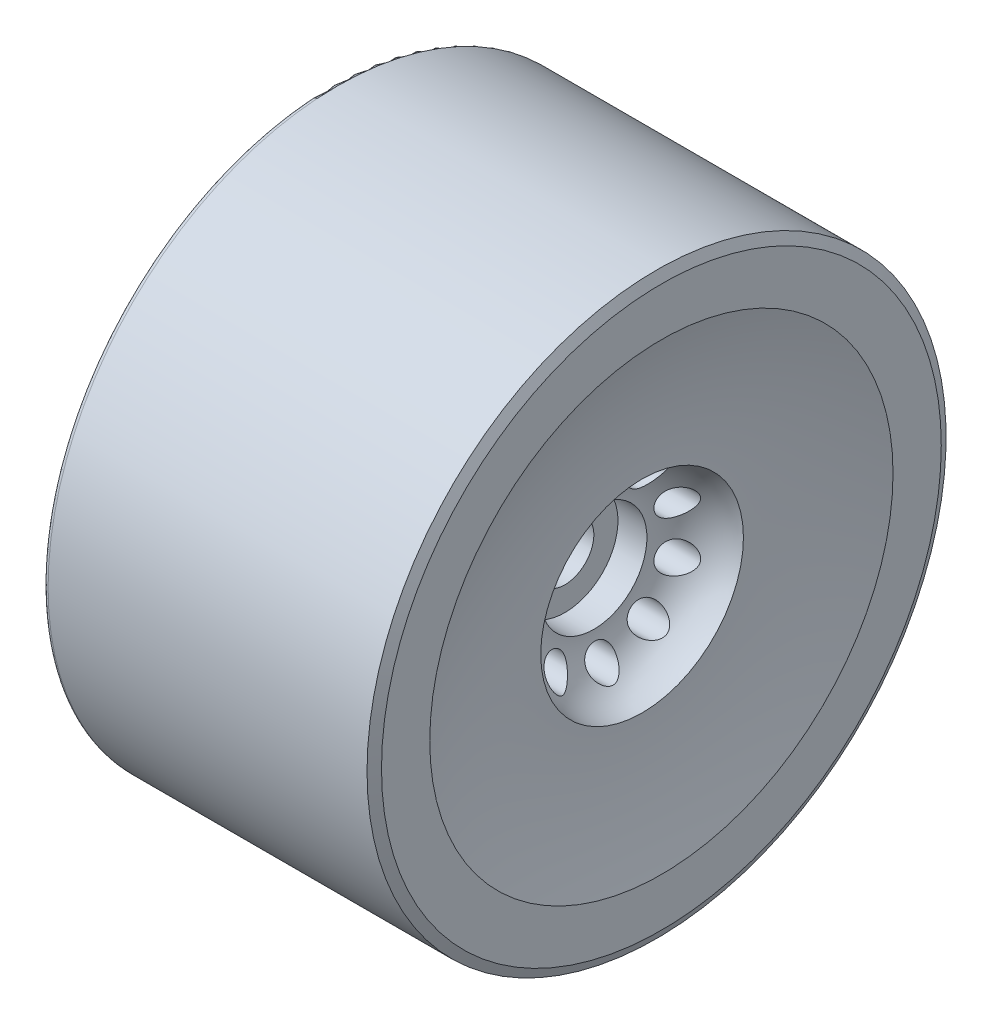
from build123d import *

# Parameters (mm, degrees)
FILLET1_R          = 1
SKETCH2_R          = 3
CUT_EXTRUDE1_DEPTH = 110.365980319


with BuildPart() as part:
    # Sketch1 → Revolve1 (revolve)
    with BuildSketch(Plane.XY, mode=Mode.PRIVATE) as revolve1_sk:
        with BuildLine():
            Line((-42, 60), (25, 60))
            Line((25, 60), (26, 58))
            Line((26, 58), (26, 48))
            ThreePointArc((26, 48), (23.005427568, 34.647344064), (22, 21))
            ThreePointArc((22, 21), (14.928932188, 18.071067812), (12, 11))
            Line((12, 11), (6, 11))
            Line((6, 11), (6, 6))
            Line((6, 6), (-6, 6))
            Line((-6, 6), (-6, 11))
            Line((-6, 11), (-12, 11))
            ThreePointArc((-12, 11), (-13.016945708, 15.393715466), (-15.860947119, 18.893796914))
            Line((-15.860947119, 18.893796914), (-43, 40))
            ThreePointArc((-43, 40), (-42.749843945, 50.012492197), (-42, 60))
        make_face()
    revolve(revolve1_sk.sketch.rotate(Axis((-0.8725464, 0, 0), (1, 0, 0)), 90), axis=Axis((-0.8725464, 0, 0), (1, 0, 0)))

    # Fillet1
    fillet1_edges = [part.edges().sort_by_distance(p)[0] for p in [
        (-43, 0, -40),
        (-42, 0, -60),
    ]]
    fillet(fillet1_edges, radius=FILLET1_R)

    # Sketch2 → Cut-Extrude1 (cut, through all)
    with BuildSketch(Plane(origin=(26, 0, 0), x_dir=(0, 0, -1), z_dir=(1, 0, 0))):
        with Locations(Location((0, 16, 0), (0, 0, 307.18308346))):
            Circle(SKETCH2_R)
        with Locations(Location((9.404564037, 12.94427191, 0), (0, 0, 37.351174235))):
            Circle(SKETCH2_R)
        with Locations(Location((15.216904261, 4.94427191, 0), (0, 0, 1.351174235))):
            Circle(SKETCH2_R)
        with Locations(Location((15.216904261, -4.94427191, 0), (0, 0, 358.648825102))):
            Circle(SKETCH2_R)
        with Locations(Location((9.404564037, -12.94427191, 0), (0, 0, 322.648826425))):
            Circle(SKETCH2_R)
        with Locations(Location((0, -16, 0), (0, 0, 318.038581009))):
            Circle(SKETCH2_R)
        with Locations(Location((-9.404564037, -12.94427191, 0), (0, 0, 319.516973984))):
            Circle(SKETCH2_R)
        with Locations(Location((-15.216904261, -4.94427191, 0), (0, 0, 311.816320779))):
            Circle(SKETCH2_R)
        with Locations(Location((-15.216904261, 4.94427191, 0), (0, 0, 311.742314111))):
            Circle(SKETCH2_R)
        with Locations(Location((-9.404564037, 12.94427191, 0), (0, 0, 316.17454395))):
            Circle(SKETCH2_R)
    extrude(amount=-CUT_EXTRUDE1_DEPTH, mode=Mode.SUBTRACT)


solid = part.part
